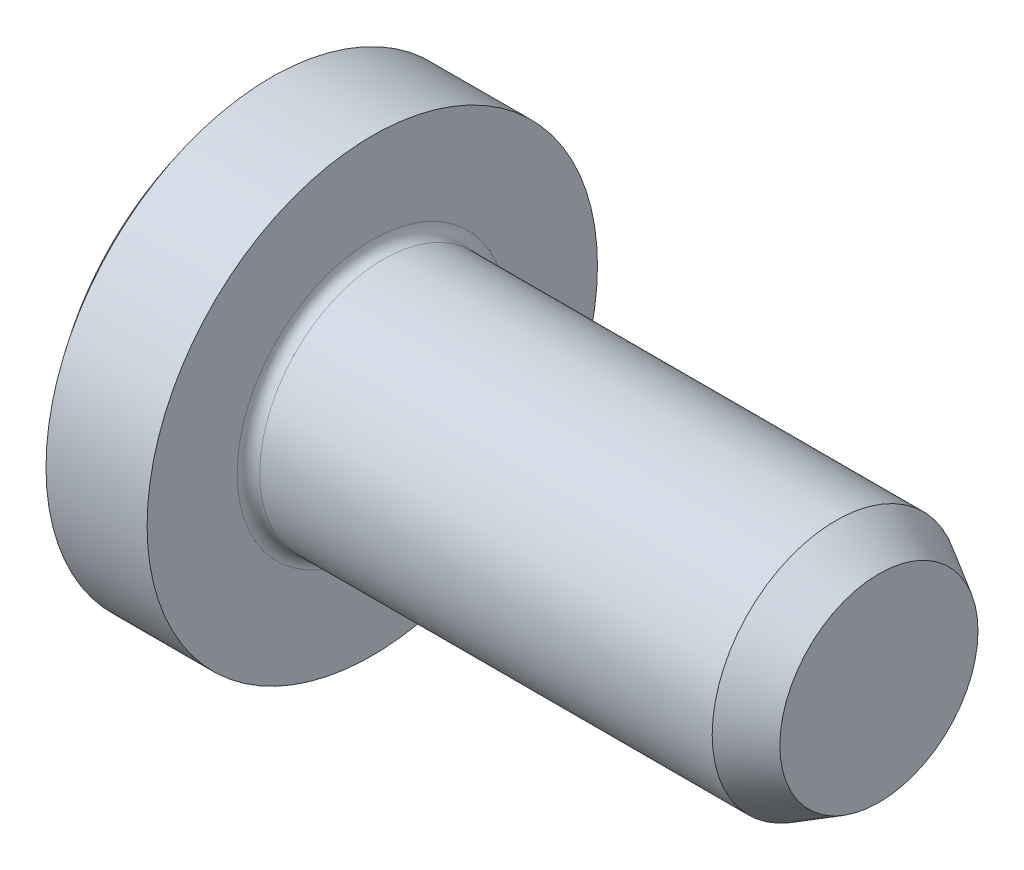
ISO-10303-21;
HEADER;
FILE_DESCRIPTION(('STEP AP214'),'2;1');
FILE_NAME('part.step','',(''),(''),'','','');
FILE_SCHEMA(('AUTOMOTIVE_DESIGN { 1 0 10303 214 1 1 1 1 }'));
ENDSEC;
DATA;
#1=APPLICATION_CONTEXT('core data for automotive mechanical design processes');
#2=APPLICATION_PROTOCOL_DEFINITION('international standard','automotive_design',2000,#1);
#3=PRODUCT_CONTEXT('',#1,'mechanical');
#4=PRODUCT('Part','Part','',(#3));
#5=PRODUCT_RELATED_PRODUCT_CATEGORY('part','',(#4));
#6=PRODUCT_DEFINITION_FORMATION('','',#4);
#7=PRODUCT_DEFINITION_CONTEXT('part definition',#1,'design');
#8=PRODUCT_DEFINITION('design','',#6,#7);
#9=PRODUCT_DEFINITION_SHAPE('','',#8);
#10=(LENGTH_UNIT() NAMED_UNIT(*) SI_UNIT(.MILLI.,.METRE.));
#11=(NAMED_UNIT(*) PLANE_ANGLE_UNIT() SI_UNIT($,.RADIAN.));
#12=(NAMED_UNIT(*) SI_UNIT($,.STERADIAN.) SOLID_ANGLE_UNIT());
#13=UNCERTAINTY_MEASURE_WITH_UNIT(LENGTH_MEASURE(1.E-05),#10,'distance_accuracy_value','');
#14=(GEOMETRIC_REPRESENTATION_CONTEXT(3) GLOBAL_UNCERTAINTY_ASSIGNED_CONTEXT((#13)) GLOBAL_UNIT_ASSIGNED_CONTEXT((#10,
#11,#12)) REPRESENTATION_CONTEXT('',''));
#15=CARTESIAN_POINT('',(0.,0.,0.));
#16=DIRECTION('',(0.,0.,1.));
#17=DIRECTION('',(1.,0.,0.));
#18=AXIS2_PLACEMENT_3D('',#15,#16,#17);
#19=CARTESIAN_POINT('',(1.6,0.,0.));
#20=DIRECTION('',(-1.,0.,0.));
#21=DIRECTION('',(0.,1.,0.));
#22=AXIS2_PLACEMENT_3D('',#19,#20,#21);
#23=SPHERICAL_SURFACE('',#22,3.2);
#24=CARTESIAN_POINT('',(-0.89799919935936,0.,0.));
#25=DIRECTION('',(-1.,0.,0.));
#26=DIRECTION('',(0.,0.,1.));
#27=AXIS2_PLACEMENT_3D('',#24,#25,#26);
#28=CIRCLE('',#27,2.);
#29=CARTESIAN_POINT('',(-0.89799919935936,0.,2.));
#30=VERTEX_POINT('',#29);
#31=EDGE_CURVE('E202',#30,#30,#28,.T.);
#32=ORIENTED_EDGE('',*,*,#31,.T.);
#33=EDGE_LOOP('',(#32));
#34=FACE_BOUND('',#33,.T.);
#35=CARTESIAN_POINT('',(1.56503616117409,0.0806815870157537,0.322726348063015));
#36=DIRECTION('',(0.104528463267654,-0.241206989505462,-0.964827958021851));
#37=DIRECTION('',(0.,0.970142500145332,-0.242535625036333));
#38=AXIS2_PLACEMENT_3D('',#35,#36,#37);
#39=CIRCLE('',#38,3.18247006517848);
#40=CARTESIAN_POINT('',(-1.45274996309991,0.934523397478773,-0.217677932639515));
#41=VERTEX_POINT('',#40);
#42=CARTESIAN_POINT('',(-1.54602165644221,0.569150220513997,-0.136439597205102));
#43=VERTEX_POINT('',#42);
#44=EDGE_CURVE('E405',#41,#43,#39,.F.);
#45=ORIENTED_EDGE('',*,*,#44,.F.);
#46=CARTESIAN_POINT('',(1.66379421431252,0.606961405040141,0.));
#47=DIRECTION('',(0.104528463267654,0.994521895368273,0.));
#48=DIRECTION('',(-0.994521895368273,0.104528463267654,0.));
#49=AXIS2_PLACEMENT_3D('',#46,#47,#48);
#50=CIRCLE('',#49,3.14126219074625);
#51=CARTESIAN_POINT('',(-1.45274996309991,0.934523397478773,0.217677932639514));
#52=VERTEX_POINT('',#51);
#53=EDGE_CURVE('E66',#52,#41,#50,.F.);
#54=ORIENTED_EDGE('',*,*,#53,.F.);
#55=CARTESIAN_POINT('',(1.56503616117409,0.0806815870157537,-0.322726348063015));
#56=DIRECTION('',(0.104528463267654,-0.241206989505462,0.964827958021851));
#57=DIRECTION('',(0.,-0.970142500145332,-0.242535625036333));
#58=AXIS2_PLACEMENT_3D('',#55,#56,#57);
#59=CIRCLE('',#58,3.18247006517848);
#60=CARTESIAN_POINT('',(-1.54602165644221,0.569150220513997,0.136439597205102));
#61=VERTEX_POINT('',#60);
#62=EDGE_CURVE('E400',#61,#52,#59,.F.);
#63=ORIENTED_EDGE('',*,*,#62,.F.);
#64=CARTESIAN_POINT('',(1.60749262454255,0.0356437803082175,0.061736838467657));
#65=DIRECTION('',(0.104528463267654,0.497260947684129,0.861281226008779));
#66=DIRECTION('',(0.,-0.866025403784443,0.499999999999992));
#67=AXIS2_PLACEMENT_3D('',#64,#65,#66);
#68=CIRCLE('',#67,3.19919707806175);
#69=CARTESIAN_POINT('',(-1.57234339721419,0.296847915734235,0.296847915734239));
#70=VERTEX_POINT('',#69);
#71=EDGE_CURVE('E392',#70,#61,#68,.F.);
#72=ORIENTED_EDGE('',*,*,#71,.F.);
#73=CARTESIAN_POINT('',(1.60749262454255,0.0617368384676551,0.0356437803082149));
#74=DIRECTION('',(0.104528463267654,0.861281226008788,0.497260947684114));
#75=DIRECTION('',(0.,-0.499999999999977,0.866025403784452));
#76=AXIS2_PLACEMENT_3D('',#73,#74,#75);
#77=CIRCLE('',#76,3.19919707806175);
#78=CARTESIAN_POINT('',(-1.54602165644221,0.136439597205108,0.569150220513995));
#79=VERTEX_POINT('',#78);
#80=EDGE_CURVE('E391',#79,#70,#77,.F.);
#81=ORIENTED_EDGE('',*,*,#80,.F.);
#82=CARTESIAN_POINT('',(1.56503616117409,-0.322726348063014,0.0806815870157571));
#83=DIRECTION('',(0.104528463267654,0.964827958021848,-0.241206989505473));
#84=DIRECTION('',(0.,0.242535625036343,0.970142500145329));
#85=AXIS2_PLACEMENT_3D('',#82,#83,#84);
#86=CIRCLE('',#85,3.18247006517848);
#87=CARTESIAN_POINT('',(-1.45274996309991,0.217677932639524,0.934523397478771));
#88=VERTEX_POINT('',#87);
#89=EDGE_CURVE('E387',#88,#79,#86,.F.);
#90=ORIENTED_EDGE('',*,*,#89,.F.);
#91=CARTESIAN_POINT('',(1.66379421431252,0.,0.606961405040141));
#92=DIRECTION('',(0.104528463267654,0.,0.994521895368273));
#93=DIRECTION('',(0.994521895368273,0.,-0.104528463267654));
#94=AXIS2_PLACEMENT_3D('',#91,#92,#93);
#95=CIRCLE('',#94,3.14126219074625);
#96=CARTESIAN_POINT('',(-1.45274996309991,-0.217677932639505,0.934523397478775));
#97=VERTEX_POINT('',#96);
#98=EDGE_CURVE('E388',#97,#88,#95,.F.);
#99=ORIENTED_EDGE('',*,*,#98,.F.);
#100=CARTESIAN_POINT('',(1.56503616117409,0.322726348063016,0.0806815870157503));
#101=DIRECTION('',(0.104528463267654,-0.964827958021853,-0.241206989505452));
#102=DIRECTION('',(0.,0.242535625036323,-0.970142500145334));
#103=AXIS2_PLACEMENT_3D('',#100,#101,#102);
#104=CIRCLE('',#103,3.18247006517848);
#105=CARTESIAN_POINT('',(-1.54602165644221,-0.136439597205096,0.569150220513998));
#106=VERTEX_POINT('',#105);
#107=EDGE_CURVE('E384',#106,#97,#104,.F.);
#108=ORIENTED_EDGE('',*,*,#107,.F.);
#109=CARTESIAN_POINT('',(1.60749262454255,-0.0617368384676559,0.0356437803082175));
#110=DIRECTION('',(0.104528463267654,-0.861281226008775,0.497260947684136));
#111=DIRECTION('',(0.,-0.499999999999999,-0.866025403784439));
#112=AXIS2_PLACEMENT_3D('',#109,#110,#111);
#113=CIRCLE('',#112,3.19919707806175);
#114=CARTESIAN_POINT('',(-1.57234339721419,-0.296847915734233,0.296847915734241));
#115=VERTEX_POINT('',#114);
#116=EDGE_CURVE('E379',#115,#106,#113,.F.);
#117=ORIENTED_EDGE('',*,*,#116,.F.);
#118=CARTESIAN_POINT('',(1.60749262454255,-0.035643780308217,0.0617368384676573));
#119=DIRECTION('',(0.104528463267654,-0.497260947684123,0.861281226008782));
#120=DIRECTION('',(0.,-0.866025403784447,-0.499999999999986));
#121=AXIS2_PLACEMENT_3D('',#118,#119,#120);
#122=CIRCLE('',#121,3.19919707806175);
#123=CARTESIAN_POINT('',(-1.54602165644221,-0.569150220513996,0.136439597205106));
#124=VERTEX_POINT('',#123);
#125=EDGE_CURVE('E380',#124,#115,#122,.F.);
#126=ORIENTED_EDGE('',*,*,#125,.F.);
#127=CARTESIAN_POINT('',(1.56503616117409,-0.0806815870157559,-0.322726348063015));
#128=DIRECTION('',(0.104528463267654,0.241206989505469,0.964827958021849));
#129=DIRECTION('',(0.,-0.97014250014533,0.242535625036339));
#130=AXIS2_PLACEMENT_3D('',#127,#128,#129);
#131=CIRCLE('',#130,3.18247006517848);
#132=CARTESIAN_POINT('',(-1.45274996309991,-0.934523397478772,0.217677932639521));
#133=VERTEX_POINT('',#132);
#134=EDGE_CURVE('E372',#133,#124,#131,.F.);
#135=ORIENTED_EDGE('',*,*,#134,.F.);
#136=CARTESIAN_POINT('',(1.66379421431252,-0.606961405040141,0.));
#137=DIRECTION('',(0.104528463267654,-0.994521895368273,0.));
#138=DIRECTION('',(0.994521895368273,0.104528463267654,0.));
#139=AXIS2_PLACEMENT_3D('',#136,#137,#138);
#140=CIRCLE('',#139,3.14126219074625);
#141=CARTESIAN_POINT('',(-1.45274996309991,-0.934523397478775,-0.217677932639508));
#142=VERTEX_POINT('',#141);
#143=EDGE_CURVE('E371',#142,#133,#140,.F.);
#144=ORIENTED_EDGE('',*,*,#143,.F.);
#145=CARTESIAN_POINT('',(1.56503616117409,-0.0806815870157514,0.322726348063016));
#146=DIRECTION('',(0.104528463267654,0.241206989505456,-0.964827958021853));
#147=DIRECTION('',(0.,0.970142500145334,0.242535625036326));
#148=AXIS2_PLACEMENT_3D('',#145,#146,#147);
#149=CIRCLE('',#148,3.18247006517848);
#150=CARTESIAN_POINT('',(-1.54602165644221,-0.569150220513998,-0.136439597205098));
#151=VERTEX_POINT('',#150);
#152=EDGE_CURVE('E368',#151,#142,#149,.F.);
#153=ORIENTED_EDGE('',*,*,#152,.F.);
#154=CARTESIAN_POINT('',(1.60749262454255,-0.0356437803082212,-0.0617368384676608));
#155=DIRECTION('',(0.104528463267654,-0.497260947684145,-0.861281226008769));
#156=DIRECTION('',(0.,0.866025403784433,-0.500000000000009));
#157=AXIS2_PLACEMENT_3D('',#154,#155,#156);
#158=CIRCLE('',#157,3.19919707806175);
#159=CARTESIAN_POINT('',(-1.57234339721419,-0.296847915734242,-0.296847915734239));
#160=VERTEX_POINT('',#159);
#161=EDGE_CURVE('E362',#160,#151,#158,.F.);
#162=ORIENTED_EDGE('',*,*,#161,.F.);
#163=CARTESIAN_POINT('',(1.60749262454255,-0.0617368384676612,-0.0356437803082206));
#164=DIRECTION('',(0.104528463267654,-0.861281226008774,-0.497260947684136));
#165=DIRECTION('',(0.,0.5,-0.866025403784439));
#166=AXIS2_PLACEMENT_3D('',#163,#164,#165);
#167=CIRCLE('',#166,3.19919707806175);
#168=CARTESIAN_POINT('',(-1.54602165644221,-0.136439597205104,-0.569150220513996));
#169=VERTEX_POINT('',#168);
#170=EDGE_CURVE('E365',#169,#160,#167,.F.);
#171=ORIENTED_EDGE('',*,*,#170,.F.);
#172=CARTESIAN_POINT('',(1.56503616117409,0.322726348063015,-0.0806815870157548));
#173=DIRECTION('',(0.104528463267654,-0.96482795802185,0.241206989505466));
#174=DIRECTION('',(0.,-0.242535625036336,-0.970142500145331));
#175=AXIS2_PLACEMENT_3D('',#172,#173,#174);
#176=CIRCLE('',#175,3.18247006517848);
#177=CARTESIAN_POINT('',(-1.45274996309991,-0.217677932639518,-0.934523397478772));
#178=VERTEX_POINT('',#177);
#179=EDGE_CURVE('E360',#178,#169,#176,.F.);
#180=ORIENTED_EDGE('',*,*,#179,.F.);
#181=CARTESIAN_POINT('',(1.66379421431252,0.,-0.606961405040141));
#182=DIRECTION('',(0.104528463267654,0.,-0.994521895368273));
#183=DIRECTION('',(-0.994521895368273,0.,-0.104528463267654));
#184=AXIS2_PLACEMENT_3D('',#181,#182,#183);
#185=CIRCLE('',#184,3.14126219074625);
#186=CARTESIAN_POINT('',(-1.45274996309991,0.217677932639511,-0.934523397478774));
#187=VERTEX_POINT('',#186);
#188=EDGE_CURVE('E358',#187,#178,#185,.F.);
#189=ORIENTED_EDGE('',*,*,#188,.F.);
#190=CARTESIAN_POINT('',(1.56503616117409,-0.322726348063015,-0.0806815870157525));
#191=DIRECTION('',(0.104528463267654,0.964827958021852,0.241206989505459));
#192=DIRECTION('',(0.,-0.242535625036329,0.970142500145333));
#193=AXIS2_PLACEMENT_3D('',#190,#191,#192);
#194=CIRCLE('',#193,3.18247006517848);
#195=CARTESIAN_POINT('',(-1.54602165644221,0.1364395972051,-0.569150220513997));
#196=VERTEX_POINT('',#195);
#197=EDGE_CURVE('E355',#196,#187,#194,.F.);
#198=ORIENTED_EDGE('',*,*,#197,.F.);
#199=CARTESIAN_POINT('',(1.60749262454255,0.0617368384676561,-0.035643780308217));
#200=DIRECTION('',(0.104528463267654,0.861281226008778,-0.497260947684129));
#201=DIRECTION('',(0.,0.499999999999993,0.866025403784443));
#202=AXIS2_PLACEMENT_3D('',#199,#200,#201);
#203=CIRCLE('',#202,3.19919707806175);
#204=CARTESIAN_POINT('',(-1.57234339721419,0.296847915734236,-0.296847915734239));
#205=VERTEX_POINT('',#204);
#206=EDGE_CURVE('E347',#205,#196,#203,.F.);
#207=ORIENTED_EDGE('',*,*,#206,.F.);
#208=CARTESIAN_POINT('',(1.60749262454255,0.0356437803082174,-0.061736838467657));
#209=DIRECTION('',(0.104528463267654,0.497260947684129,-0.861281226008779));
#210=DIRECTION('',(0.,0.866025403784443,0.499999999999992));
#211=AXIS2_PLACEMENT_3D('',#208,#209,#210);
#212=CIRCLE('',#211,3.19919707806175);
#213=EDGE_CURVE('E346',#43,#205,#212,.F.);
#214=ORIENTED_EDGE('',*,*,#213,.F.);
#215=EDGE_LOOP('',(#45,#54,#63,#72,#81,#90,#99,#108,#117,#126,#135,#144,#153,#162,#171,#180,
#189,#198,#207,#214));
#216=FACE_BOUND('',#215,.T.);
#217=ADVANCED_FACE('F43',(#34,#216),#23,.T.);
#218=CARTESIAN_POINT('',(0.,1.1,0.));
#219=DIRECTION('',(-1.,0.,0.));
#220=DIRECTION('',(0.,0.,1.));
#221=AXIS2_PLACEMENT_3D('',#218,#219,#220);
#222=PLANE('',#221);
#223=CARTESIAN_POINT('',(0.,0.,0.));
#224=DIRECTION('',(-1.,0.,0.));
#225=DIRECTION('',(0.,0.,1.));
#226=AXIS2_PLACEMENT_3D('',#223,#224,#225);
#227=CIRCLE('',#226,1.2);
#228=CARTESIAN_POINT('',(0.,0.,1.2));
#229=VERTEX_POINT('',#228);
#230=EDGE_CURVE('E55',#229,#229,#227,.T.);
#231=ORIENTED_EDGE('',*,*,#230,.T.);
#232=EDGE_LOOP('',(#231));
#233=FACE_BOUND('',#232,.T.);
#234=CARTESIAN_POINT('',(0.,0.,0.));
#235=DIRECTION('',(-1.,0.,0.));
#236=DIRECTION('',(0.,0.,1.));
#237=AXIS2_PLACEMENT_3D('',#234,#235,#236);
#238=CIRCLE('',#237,2.);
#239=CARTESIAN_POINT('',(0.,0.,2.));
#240=VERTEX_POINT('',#239);
#241=EDGE_CURVE('E206',#240,#240,#238,.T.);
#242=ORIENTED_EDGE('',*,*,#241,.F.);
#243=EDGE_LOOP('',(#242));
#244=FACE_BOUND('',#243,.T.);
#245=ADVANCED_FACE('F407',(#233,#244),#222,.F.);
#246=CARTESIAN_POINT('',(0.,0.,0.));
#247=DIRECTION('',(-1.,0.,0.));
#248=DIRECTION('',(0.,0.,1.));
#249=AXIS2_PLACEMENT_3D('',#246,#247,#248);
#250=CYLINDRICAL_SURFACE('',#249,2.);
#251=ORIENTED_EDGE('',*,*,#31,.F.);
#252=EDGE_LOOP('',(#251));
#253=FACE_BOUND('',#252,.T.);
#254=ORIENTED_EDGE('',*,*,#241,.T.);
#255=EDGE_LOOP('',(#254));
#256=FACE_BOUND('',#255,.T.);
#257=ADVANCED_FACE('F429',(#253,#256),#250,.T.);
#258=CARTESIAN_POINT('',(4.5,1.1,0.));
#259=DIRECTION('',(-1.,0.,0.));
#260=DIRECTION('',(0.,0.,1.));
#261=AXIS2_PLACEMENT_3D('',#258,#259,#260);
#262=PLANE('',#261);
#263=CARTESIAN_POINT('',(4.5,0.,0.));
#264=DIRECTION('',(-1.,0.,0.));
#265=DIRECTION('',(0.,0.,1.));
#266=AXIS2_PLACEMENT_3D('',#263,#264,#265);
#267=CIRCLE('',#266,0.88);
#268=CARTESIAN_POINT('',(4.5,0.,0.88));
#269=VERTEX_POINT('',#268);
#270=EDGE_CURVE('E341',#269,#269,#267,.F.);
#271=ORIENTED_EDGE('',*,*,#270,.T.);
#272=EDGE_LOOP('',(#271));
#273=FACE_BOUND('',#272,.T.);
#274=ADVANCED_FACE('F432',(#273),#262,.F.);
#275=CARTESIAN_POINT('',(0.,0.,0.));
#276=DIRECTION('',(-1.,0.,0.));
#277=DIRECTION('',(0.,0.,1.));
#278=AXIS2_PLACEMENT_3D('',#275,#276,#277);
#279=CYLINDRICAL_SURFACE('',#278,1.1);
#280=CARTESIAN_POINT('',(0.1,0.,0.));
#281=DIRECTION('',(-1.,0.,0.));
#282=DIRECTION('',(0.,0.,1.));
#283=AXIS2_PLACEMENT_3D('',#280,#281,#282);
#284=CIRCLE('',#283,1.1);
#285=CARTESIAN_POINT('',(0.1,0.,1.1));
#286=VERTEX_POINT('',#285);
#287=EDGE_CURVE('E11',#286,#286,#284,.F.);
#288=ORIENTED_EDGE('',*,*,#287,.T.);
#289=EDGE_LOOP('',(#288));
#290=FACE_BOUND('',#289,.T.);
#291=CARTESIAN_POINT('',(4.11894882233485,0.,0.));
#292=DIRECTION('',(-1.,0.,0.));
#293=DIRECTION('',(0.,0.,1.));
#294=AXIS2_PLACEMENT_3D('',#291,#292,#293);
#295=CIRCLE('',#294,1.1);
#296=CARTESIAN_POINT('',(4.11894882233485,0.,1.1));
#297=VERTEX_POINT('',#296);
#298=EDGE_CURVE('E339',#297,#297,#295,.T.);
#299=ORIENTED_EDGE('',*,*,#298,.T.);
#300=EDGE_LOOP('',(#299));
#301=FACE_BOUND('',#300,.T.);
#302=ADVANCED_FACE('F437',(#290,#301),#279,.T.);
#303=CARTESIAN_POINT('',(4.11894882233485,0.,0.));
#304=DIRECTION('',(-1.,0.,0.));
#305=DIRECTION('',(0.,0.,1.));
#306=AXIS2_PLACEMENT_3D('',#303,#304,#305);
#307=CONICAL_SURFACE('',#306,1.1,0.523598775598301);
#308=ORIENTED_EDGE('',*,*,#270,.F.);
#309=EDGE_LOOP('',(#308));
#310=FACE_BOUND('',#309,.T.);
#311=ORIENTED_EDGE('',*,*,#298,.F.);
#312=EDGE_LOOP('',(#311));
#313=FACE_BOUND('',#312,.T.);
#314=ADVANCED_FACE('F438',(#310,#313),#307,.T.);
#315=CARTESIAN_POINT('',(-1.6,0.95,-0.2375));
#316=DIRECTION('',(0.104528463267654,-0.241206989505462,-0.964827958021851));
#317=DIRECTION('',(0.,0.970142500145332,-0.242535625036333));
#318=AXIS2_PLACEMENT_3D('',#315,#316,#317);
#319=PLANE('',#318);
#320=ORIENTED_EDGE('',*,*,#44,.T.);
#321=DIRECTION('',(-0.993634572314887,0.0156427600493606,-0.111560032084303));
#322=VECTOR('',#321,1.);
#323=CARTESIAN_POINT('',(-1.6,0.57,-0.1425));
#324=LINE('',#323,#322);
#325=CARTESIAN_POINT('',(-0.8,0.557405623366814,-0.052680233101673));
#326=VERTEX_POINT('',#325);
#327=EDGE_CURVE('E56',#326,#43,#324,.T.);
#328=ORIENTED_EDGE('',*,*,#327,.F.);
#329=DIRECTION('',(0.,-0.970142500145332,0.242535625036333));
#330=VECTOR('',#329,1.);
#331=CARTESIAN_POINT('',(-0.8,0.0203932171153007,0.081572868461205));
#332=LINE('',#331,#330);
#333=CARTESIAN_POINT('',(-0.8,0.865916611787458,-0.129807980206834));
#334=VERTEX_POINT('',#333);
#335=EDGE_CURVE('E190',#326,#334,#332,.F.);
#336=ORIENTED_EDGE('',*,*,#335,.T.);
#337=DIRECTION('',(-0.985727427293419,0.103604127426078,-0.132693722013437));
#338=VECTOR('',#337,1.);
#339=CARTESIAN_POINT('',(-1.53787007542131,0.943469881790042,-0.229136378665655));
#340=LINE('',#339,#338);
#341=EDGE_CURVE('E194',#334,#41,#340,.T.);
#342=ORIENTED_EDGE('',*,*,#341,.T.);
#343=EDGE_LOOP('',(#320,#328,#336,#342));
#344=FACE_BOUND('',#343,.T.);
#345=ADVANCED_FACE('F192',(#344),#319,.F.);
#346=CARTESIAN_POINT('',(-1.6,0.95,0.2375));
#347=DIRECTION('',(0.104528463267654,0.994521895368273,0.));
#348=DIRECTION('',(-0.994521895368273,0.104528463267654,0.));
#349=AXIS2_PLACEMENT_3D('',#346,#347,#348);
#350=PLANE('',#349);
#351=ORIENTED_EDGE('',*,*,#53,.T.);
#352=ORIENTED_EDGE('',*,*,#341,.F.);
#353=DIRECTION('',(0.,0.,-1.));
#354=VECTOR('',#353,1.);
#355=CARTESIAN_POINT('',(-0.8,0.865916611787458,0.));
#356=LINE('',#355,#354);
#357=CARTESIAN_POINT('',(-0.8,0.865916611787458,0.129807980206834));
#358=VERTEX_POINT('',#357);
#359=EDGE_CURVE('E182',#334,#358,#356,.F.);
#360=ORIENTED_EDGE('',*,*,#359,.T.);
#361=DIRECTION('',(-0.985727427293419,0.103604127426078,0.132693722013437));
#362=VECTOR('',#361,1.);
#363=CARTESIAN_POINT('',(-1.6,0.95,0.2375));
#364=LINE('',#363,#362);
#365=EDGE_CURVE('E204',#358,#52,#364,.T.);
#366=ORIENTED_EDGE('',*,*,#365,.T.);
#367=EDGE_LOOP('',(#351,#352,#360,#366));
#368=FACE_BOUND('',#367,.T.);
#369=ADVANCED_FACE('F198',(#368),#350,.F.);
#370=CARTESIAN_POINT('',(-1.6,0.95,0.2375));
#371=DIRECTION('',(0.104528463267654,-0.241206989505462,0.964827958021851));
#372=DIRECTION('',(0.,-0.970142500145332,-0.242535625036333));
#373=AXIS2_PLACEMENT_3D('',#370,#371,#372);
#374=PLANE('',#373);
#375=ORIENTED_EDGE('',*,*,#62,.T.);
#376=ORIENTED_EDGE('',*,*,#365,.F.);
#377=DIRECTION('',(0.,0.970142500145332,0.242535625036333));
#378=VECTOR('',#377,1.);
#379=CARTESIAN_POINT('',(-0.8,0.0203932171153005,-0.0815728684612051));
#380=LINE('',#379,#378);
#381=CARTESIAN_POINT('',(-0.8,0.557405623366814,0.052680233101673));
#382=VERTEX_POINT('',#381);
#383=EDGE_CURVE('E186',#358,#382,#380,.F.);
#384=ORIENTED_EDGE('',*,*,#383,.T.);
#385=DIRECTION('',(-0.993634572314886,0.0156427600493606,0.111560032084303));
#386=VECTOR('',#385,1.);
#387=CARTESIAN_POINT('',(-1.61643715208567,0.57025876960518,0.14434547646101));
#388=LINE('',#387,#386);
#389=EDGE_CURVE('E213',#382,#61,#388,.T.);
#390=ORIENTED_EDGE('',*,*,#389,.T.);
#391=EDGE_LOOP('',(#375,#376,#384,#390));
#392=FACE_BOUND('',#391,.T.);
#393=ADVANCED_FACE('F497',(#392),#374,.F.);
#394=CARTESIAN_POINT('',(-1.6,0.57,0.1425));
#395=DIRECTION('',(0.104528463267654,0.497260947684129,0.861281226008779));
#396=DIRECTION('',(0.,-0.866025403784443,0.499999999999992));
#397=AXIS2_PLACEMENT_3D('',#394,#395,#396);
#398=PLANE('',#397);
#399=ORIENTED_EDGE('',*,*,#71,.T.);
#400=ORIENTED_EDGE('',*,*,#389,.F.);
#401=DIRECTION('',(0.,0.866025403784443,-0.499999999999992));
#402=VECTOR('',#401,1.);
#403=CARTESIAN_POINT('',(-0.8,0.162162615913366,0.280873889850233));
#404=LINE('',#403,#402);
#405=CARTESIAN_POINT('',(-0.8,0.237422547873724,0.237422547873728));
#406=VERTEX_POINT('',#405);
#407=EDGE_CURVE('E287',#382,#406,#404,.F.);
#408=ORIENTED_EDGE('',*,*,#407,.T.);
#409=DIRECTION('',(-0.994132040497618,0.0764901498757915,0.0764901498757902));
#410=VECTOR('',#409,1.);
#411=CARTESIAN_POINT('',(-1.60871040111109,0.299646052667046,0.299646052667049));
#412=LINE('',#411,#410);
#413=EDGE_CURVE('E280',#406,#70,#412,.T.);
#414=ORIENTED_EDGE('',*,*,#413,.T.);
#415=EDGE_LOOP('',(#399,#400,#408,#414));
#416=FACE_BOUND('',#415,.T.);
#417=ADVANCED_FACE('F507',(#416),#398,.F.);
#418=CARTESIAN_POINT('',(-1.6,0.142500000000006,0.569999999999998));
#419=DIRECTION('',(0.104528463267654,0.861281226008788,0.497260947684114));
#420=DIRECTION('',(0.,-0.499999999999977,0.866025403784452));
#421=AXIS2_PLACEMENT_3D('',#418,#419,#420);
#422=PLANE('',#421);
#423=ORIENTED_EDGE('',*,*,#80,.T.);
#424=ORIENTED_EDGE('',*,*,#413,.F.);
#425=DIRECTION('',(0.,0.499999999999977,-0.866025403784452));
#426=VECTOR('',#425,1.);
#427=CARTESIAN_POINT('',(-0.8,0.280873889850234,0.16216261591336));
#428=LINE('',#427,#426);
#429=CARTESIAN_POINT('',(-0.8,0.0526802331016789,0.557405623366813));
#430=VERTEX_POINT('',#429);
#431=EDGE_CURVE('E286',#406,#430,#428,.F.);
#432=ORIENTED_EDGE('',*,*,#431,.T.);
#433=DIRECTION('',(-0.993634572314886,0.111560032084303,0.0156427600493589));
#434=VECTOR('',#433,1.);
#435=CARTESIAN_POINT('',(-1.6,0.142500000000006,0.569999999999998));
#436=LINE('',#435,#434);
#437=EDGE_CURVE('E271',#430,#79,#436,.T.);
#438=ORIENTED_EDGE('',*,*,#437,.T.);
#439=EDGE_LOOP('',(#423,#424,#432,#438));
#440=FACE_BOUND('',#439,.T.);
#441=ADVANCED_FACE('F516',(#440),#422,.F.);
#442=CARTESIAN_POINT('',(-1.6,0.23750000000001,0.949999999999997));
#443=DIRECTION('',(0.104528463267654,0.964827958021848,-0.241206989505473));
#444=DIRECTION('',(0.,0.242535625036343,0.970142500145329));
#445=AXIS2_PLACEMENT_3D('',#442,#443,#444);
#446=PLANE('',#445);
#447=ORIENTED_EDGE('',*,*,#89,.T.);
#448=ORIENTED_EDGE('',*,*,#437,.F.);
#449=DIRECTION('',(0.,-0.242535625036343,-0.970142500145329));
#450=VECTOR('',#449,1.);
#451=CARTESIAN_POINT('',(-0.8,-0.0815728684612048,0.0203932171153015));
#452=LINE('',#451,#450);
#453=CARTESIAN_POINT('',(-0.8,0.129807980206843,0.865916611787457));
#454=VERTEX_POINT('',#453);
#455=EDGE_CURVE('E292',#430,#454,#452,.F.);
#456=ORIENTED_EDGE('',*,*,#455,.T.);
#457=DIRECTION('',(-0.985727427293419,0.132693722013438,0.103604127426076));
#458=VECTOR('',#457,1.);
#459=CARTESIAN_POINT('',(-1.53787007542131,0.229136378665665,0.94346988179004));
#460=LINE('',#459,#458);
#461=EDGE_CURVE('E266',#454,#88,#460,.T.);
#462=ORIENTED_EDGE('',*,*,#461,.T.);
#463=EDGE_LOOP('',(#447,#448,#456,#462));
#464=FACE_BOUND('',#463,.T.);
#465=ADVANCED_FACE('F530',(#464),#446,.F.);
#466=CARTESIAN_POINT('',(-1.6,-0.23749999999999,0.950000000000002));
#467=DIRECTION('',(0.104528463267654,0.,0.994521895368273));
#468=DIRECTION('',(0.994521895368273,0.,-0.104528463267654));
#469=AXIS2_PLACEMENT_3D('',#466,#467,#468);
#470=PLANE('',#469);
#471=ORIENTED_EDGE('',*,*,#98,.T.);
#472=ORIENTED_EDGE('',*,*,#461,.F.);
#473=DIRECTION('',(0.,1.,0.));
#474=VECTOR('',#473,1.);
#475=CARTESIAN_POINT('',(-0.8,0.,0.865916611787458));
#476=LINE('',#475,#474);
#477=CARTESIAN_POINT('',(-0.8,-0.129807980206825,0.86591661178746));
#478=VERTEX_POINT('',#477);
#479=EDGE_CURVE('E294',#454,#478,#476,.F.);
#480=ORIENTED_EDGE('',*,*,#479,.T.);
#481=DIRECTION('',(-0.985727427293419,-0.132693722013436,0.103604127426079));
#482=VECTOR('',#481,1.);
#483=CARTESIAN_POINT('',(-1.6,-0.23749999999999,0.950000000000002));
#484=LINE('',#483,#482);
#485=EDGE_CURVE('E262',#478,#97,#484,.T.);
#486=ORIENTED_EDGE('',*,*,#485,.T.);
#487=EDGE_LOOP('',(#471,#472,#480,#486));
#488=FACE_BOUND('',#487,.T.);
#489=ADVANCED_FACE('F536',(#488),#470,.F.);
#490=CARTESIAN_POINT('',(-1.6,-0.23749999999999,0.950000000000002));
#491=DIRECTION('',(0.104528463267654,-0.964827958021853,-0.241206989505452));
#492=DIRECTION('',(0.,0.242535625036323,-0.970142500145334));
#493=AXIS2_PLACEMENT_3D('',#490,#491,#492);
#494=PLANE('',#493);
#495=ORIENTED_EDGE('',*,*,#107,.T.);
#496=ORIENTED_EDGE('',*,*,#485,.F.);
#497=DIRECTION('',(0.,-0.242535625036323,0.970142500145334));
#498=VECTOR('',#497,1.);
#499=CARTESIAN_POINT('',(-0.8,0.0815728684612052,0.0203932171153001));
#500=LINE('',#499,#498);
#501=CARTESIAN_POINT('',(-0.8,-0.0526802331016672,0.557405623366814));
#502=VERTEX_POINT('',#501);
#503=EDGE_CURVE('E296',#478,#502,#500,.F.);
#504=ORIENTED_EDGE('',*,*,#503,.T.);
#505=DIRECTION('',(-0.993634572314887,-0.111560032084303,0.0156427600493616));
#506=VECTOR('',#505,1.);
#507=CARTESIAN_POINT('',(-1.61643715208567,-0.144345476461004,0.570258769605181));
#508=LINE('',#507,#506);
#509=EDGE_CURVE('E264',#502,#106,#508,.T.);
#510=ORIENTED_EDGE('',*,*,#509,.T.);
#511=EDGE_LOOP('',(#495,#496,#504,#510));
#512=FACE_BOUND('',#511,.T.);
#513=ADVANCED_FACE('F550',(#512),#494,.F.);
#514=CARTESIAN_POINT('',(-1.6,-0.142499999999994,0.570000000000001));
#515=DIRECTION('',(0.104528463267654,-0.861281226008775,0.497260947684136));
#516=DIRECTION('',(0.,-0.499999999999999,-0.866025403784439));
#517=AXIS2_PLACEMENT_3D('',#514,#515,#516);
#518=PLANE('',#517);
#519=ORIENTED_EDGE('',*,*,#116,.T.);
#520=ORIENTED_EDGE('',*,*,#509,.F.);
#521=DIRECTION('',(0.,0.499999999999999,0.866025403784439));
#522=VECTOR('',#521,1.);
#523=CARTESIAN_POINT('',(-0.8,-0.280873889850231,0.162162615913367));
#524=LINE('',#523,#522);
#525=CARTESIAN_POINT('',(-0.8,-0.237422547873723,0.23742254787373));
#526=VERTEX_POINT('',#525);
#527=EDGE_CURVE('E301',#502,#526,#524,.F.);
#528=ORIENTED_EDGE('',*,*,#527,.T.);
#529=DIRECTION('',(-0.994132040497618,-0.07649014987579,0.0764901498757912));
#530=VECTOR('',#529,1.);
#531=CARTESIAN_POINT('',(-1.60871040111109,-0.299646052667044,0.299646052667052));
#532=LINE('',#531,#530);
#533=EDGE_CURVE('E260',#526,#115,#532,.T.);
#534=ORIENTED_EDGE('',*,*,#533,.T.);
#535=EDGE_LOOP('',(#519,#520,#528,#534));
#536=FACE_BOUND('',#535,.T.);
#537=ADVANCED_FACE('F556',(#536),#518,.F.);
#538=CARTESIAN_POINT('',(-1.6,-0.569999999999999,0.142500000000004));
#539=DIRECTION('',(0.104528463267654,-0.497260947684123,0.861281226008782));
#540=DIRECTION('',(0.,-0.866025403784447,-0.499999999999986));
#541=AXIS2_PLACEMENT_3D('',#538,#539,#540);
#542=PLANE('',#541);
#543=ORIENTED_EDGE('',*,*,#125,.T.);
#544=ORIENTED_EDGE('',*,*,#533,.F.);
#545=DIRECTION('',(0.,0.866025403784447,0.499999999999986));
#546=VECTOR('',#545,1.);
#547=CARTESIAN_POINT('',(-0.8,-0.162162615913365,0.280873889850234));
#548=LINE('',#547,#546);
#549=CARTESIAN_POINT('',(-0.8,-0.557405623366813,0.0526802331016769));
#550=VERTEX_POINT('',#549);
#551=EDGE_CURVE('E302',#526,#550,#548,.F.);
#552=ORIENTED_EDGE('',*,*,#551,.T.);
#553=DIRECTION('',(-0.993634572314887,-0.0156427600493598,0.111560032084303));
#554=VECTOR('',#553,1.);
#555=CARTESIAN_POINT('',(-1.6,-0.569999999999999,0.142500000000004));
#556=LINE('',#555,#554);
#557=EDGE_CURVE('E254',#550,#124,#556,.T.);
#558=ORIENTED_EDGE('',*,*,#557,.T.);
#559=EDGE_LOOP('',(#543,#544,#552,#558));
#560=FACE_BOUND('',#559,.T.);
#561=ADVANCED_FACE('F568',(#560),#542,.F.);
#562=CARTESIAN_POINT('',(-1.6,-0.949999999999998,0.237500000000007));
#563=DIRECTION('',(0.104528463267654,0.241206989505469,0.964827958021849));
#564=DIRECTION('',(0.,-0.97014250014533,0.242535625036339));
#565=AXIS2_PLACEMENT_3D('',#562,#563,#564);
#566=PLANE('',#565);
#567=ORIENTED_EDGE('',*,*,#134,.T.);
#568=ORIENTED_EDGE('',*,*,#557,.F.);
#569=DIRECTION('',(0.,0.97014250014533,-0.242535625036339));
#570=VECTOR('',#569,1.);
#571=CARTESIAN_POINT('',(-0.8,-0.0203932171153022,-0.0815728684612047));
#572=LINE('',#571,#570);
#573=CARTESIAN_POINT('',(-0.8,-0.865916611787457,0.12980798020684));
#574=VERTEX_POINT('',#573);
#575=EDGE_CURVE('E310',#550,#574,#572,.F.);
#576=ORIENTED_EDGE('',*,*,#575,.T.);
#577=DIRECTION('',(-0.985727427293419,-0.103604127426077,0.132693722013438));
#578=VECTOR('',#577,1.);
#579=CARTESIAN_POINT('',(-1.53787007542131,-0.943469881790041,0.229136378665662));
#580=LINE('',#579,#578);
#581=EDGE_CURVE('E248',#574,#133,#580,.T.);
#582=ORIENTED_EDGE('',*,*,#581,.T.);
#583=EDGE_LOOP('',(#567,#568,#576,#582));
#584=FACE_BOUND('',#583,.T.);
#585=ADVANCED_FACE('F579',(#584),#566,.F.);
#586=CARTESIAN_POINT('',(-1.6,-0.950000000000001,-0.237499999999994));
#587=DIRECTION('',(0.104528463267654,-0.994521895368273,0.));
#588=DIRECTION('',(0.994521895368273,0.104528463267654,0.));
#589=AXIS2_PLACEMENT_3D('',#586,#587,#588);
#590=PLANE('',#589);
#591=ORIENTED_EDGE('',*,*,#143,.T.);
#592=ORIENTED_EDGE('',*,*,#581,.F.);
#593=DIRECTION('',(0.,0.,1.));
#594=VECTOR('',#593,1.);
#595=CARTESIAN_POINT('',(-0.8,-0.865916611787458,0.));
#596=LINE('',#595,#594);
#597=CARTESIAN_POINT('',(-0.8,-0.865916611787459,-0.129807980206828));
#598=VERTEX_POINT('',#597);
#599=EDGE_CURVE('E309',#574,#598,#596,.F.);
#600=ORIENTED_EDGE('',*,*,#599,.T.);
#601=DIRECTION('',(-0.985727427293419,-0.103604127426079,-0.132693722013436));
#602=VECTOR('',#601,1.);
#603=CARTESIAN_POINT('',(-1.6,-0.950000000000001,-0.237499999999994));
#604=LINE('',#603,#602);
#605=EDGE_CURVE('E244',#598,#142,#604,.T.);
#606=ORIENTED_EDGE('',*,*,#605,.T.);
#607=EDGE_LOOP('',(#591,#592,#600,#606));
#608=FACE_BOUND('',#607,.T.);
#609=ADVANCED_FACE('F590',(#608),#590,.F.);
#610=CARTESIAN_POINT('',(-1.6,-0.950000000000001,-0.237499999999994));
#611=DIRECTION('',(0.104528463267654,0.241206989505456,-0.964827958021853));
#612=DIRECTION('',(0.,0.970142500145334,0.242535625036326));
#613=AXIS2_PLACEMENT_3D('',#610,#611,#612);
#614=PLANE('',#613);
#615=ORIENTED_EDGE('',*,*,#152,.T.);
#616=ORIENTED_EDGE('',*,*,#605,.F.);
#617=DIRECTION('',(0.,-0.970142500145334,-0.242535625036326));
#618=VECTOR('',#617,1.);
#619=CARTESIAN_POINT('',(-0.8,-0.0203932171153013,0.0815728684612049));
#620=LINE('',#619,#618);
#621=CARTESIAN_POINT('',(-0.8,-0.557405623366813,-0.052680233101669));
#622=VERTEX_POINT('',#621);
#623=EDGE_CURVE('E312',#598,#622,#620,.F.);
#624=ORIENTED_EDGE('',*,*,#623,.T.);
#625=DIRECTION('',(-0.993634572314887,-0.0156427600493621,-0.111560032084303));
#626=VECTOR('',#625,1.);
#627=CARTESIAN_POINT('',(-1.61643715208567,-0.570258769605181,-0.144345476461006));
#628=LINE('',#627,#626);
#629=EDGE_CURVE('E241',#622,#151,#628,.T.);
#630=ORIENTED_EDGE('',*,*,#629,.T.);
#631=EDGE_LOOP('',(#615,#616,#624,#630));
#632=FACE_BOUND('',#631,.T.);
#633=ADVANCED_FACE('F596',(#632),#614,.F.);
#634=CARTESIAN_POINT('',(-1.6,-0.570000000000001,-0.142499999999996));
#635=DIRECTION('',(0.104528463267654,-0.497260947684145,-0.861281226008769));
#636=DIRECTION('',(0.,0.866025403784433,-0.500000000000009));
#637=AXIS2_PLACEMENT_3D('',#634,#635,#636);
#638=PLANE('',#637);
#639=ORIENTED_EDGE('',*,*,#161,.T.);
#640=ORIENTED_EDGE('',*,*,#629,.F.);
#641=DIRECTION('',(0.,-0.866025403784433,0.500000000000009));
#642=VECTOR('',#641,1.);
#643=CARTESIAN_POINT('',(-0.8,-0.162162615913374,-0.280873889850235));
#644=LINE('',#643,#642);
#645=CARTESIAN_POINT('',(-0.8,-0.237422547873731,-0.237422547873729));
#646=VERTEX_POINT('',#645);
#647=EDGE_CURVE('E317',#622,#646,#644,.F.);
#648=ORIENTED_EDGE('',*,*,#647,.T.);
#649=DIRECTION('',(-0.994132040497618,-0.0764901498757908,-0.07649014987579));
#650=VECTOR('',#649,1.);
#651=CARTESIAN_POINT('',(-1.60871040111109,-0.299646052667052,-0.299646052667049));
#652=LINE('',#651,#650);
#653=EDGE_CURVE('E240',#646,#160,#652,.T.);
#654=ORIENTED_EDGE('',*,*,#653,.T.);
#655=EDGE_LOOP('',(#639,#640,#648,#654));
#656=FACE_BOUND('',#655,.T.);
#657=ADVANCED_FACE('F610',(#656),#638,.F.);
#658=CARTESIAN_POINT('',(-1.6,-0.142500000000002,-0.569999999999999));
#659=DIRECTION('',(0.104528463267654,-0.861281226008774,-0.497260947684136));
#660=DIRECTION('',(0.,0.5,-0.866025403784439));
#661=AXIS2_PLACEMENT_3D('',#658,#659,#660);
#662=PLANE('',#661);
#663=ORIENTED_EDGE('',*,*,#170,.T.);
#664=ORIENTED_EDGE('',*,*,#653,.F.);
#665=DIRECTION('',(0.,-0.5,0.866025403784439));
#666=VECTOR('',#665,1.);
#667=CARTESIAN_POINT('',(-0.8,-0.280873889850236,-0.162162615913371));
#668=LINE('',#667,#666);
#669=CARTESIAN_POINT('',(-0.8,-0.0526802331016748,-0.557405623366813));
#670=VERTEX_POINT('',#669);
#671=EDGE_CURVE('E316',#646,#670,#668,.F.);
#672=ORIENTED_EDGE('',*,*,#671,.T.);
#673=DIRECTION('',(-0.993634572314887,-0.111560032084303,-0.0156427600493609));
#674=VECTOR('',#673,1.);
#675=CARTESIAN_POINT('',(-1.6,-0.142500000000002,-0.569999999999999));
#676=LINE('',#675,#674);
#677=EDGE_CURVE('E231',#670,#169,#676,.T.);
#678=ORIENTED_EDGE('',*,*,#677,.T.);
#679=EDGE_LOOP('',(#663,#664,#672,#678));
#680=FACE_BOUND('',#679,.T.);
#681=ADVANCED_FACE('F616',(#680),#662,.F.);
#682=CARTESIAN_POINT('',(-1.6,-0.237500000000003,-0.949999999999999));
#683=DIRECTION('',(0.104528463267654,-0.96482795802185,0.241206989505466));
#684=DIRECTION('',(0.,-0.242535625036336,-0.970142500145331));
#685=AXIS2_PLACEMENT_3D('',#682,#683,#684);
#686=PLANE('',#685);
#687=ORIENTED_EDGE('',*,*,#179,.T.);
#688=ORIENTED_EDGE('',*,*,#677,.F.);
#689=DIRECTION('',(0.,0.242535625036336,0.970142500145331));
#690=VECTOR('',#689,1.);
#691=CARTESIAN_POINT('',(-0.8,0.0815728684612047,-0.020393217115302));
#692=LINE('',#691,#690);
#693=CARTESIAN_POINT('',(-0.8,-0.129807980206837,-0.865916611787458));
#694=VERTEX_POINT('',#693);
#695=EDGE_CURVE('E325',#670,#694,#692,.F.);
#696=ORIENTED_EDGE('',*,*,#695,.T.);
#697=DIRECTION('',(-0.985727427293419,-0.132693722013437,-0.103604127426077));
#698=VECTOR('',#697,1.);
#699=CARTESIAN_POINT('',(-1.53787007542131,-0.229136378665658,-0.943469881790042));
#700=LINE('',#699,#698);
#701=EDGE_CURVE('E230',#694,#178,#700,.T.);
#702=ORIENTED_EDGE('',*,*,#701,.T.);
#703=EDGE_LOOP('',(#687,#688,#696,#702));
#704=FACE_BOUND('',#703,.T.);
#705=ADVANCED_FACE('F628',(#704),#686,.F.);
#706=CARTESIAN_POINT('',(-1.6,0.237499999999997,-0.950000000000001));
#707=DIRECTION('',(0.104528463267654,0.,-0.994521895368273));
#708=DIRECTION('',(-0.994521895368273,0.,-0.104528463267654));
#709=AXIS2_PLACEMENT_3D('',#706,#707,#708);
#710=PLANE('',#709);
#711=ORIENTED_EDGE('',*,*,#188,.T.);
#712=ORIENTED_EDGE('',*,*,#701,.F.);
#713=DIRECTION('',(0.,-1.,0.));
#714=VECTOR('',#713,1.);
#715=CARTESIAN_POINT('',(-0.8,0.,-0.865916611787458));
#716=LINE('',#715,#714);
#717=CARTESIAN_POINT('',(-0.8,0.129807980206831,-0.865916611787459));
#718=VERTEX_POINT('',#717);
#719=EDGE_CURVE('E324',#694,#718,#716,.F.);
#720=ORIENTED_EDGE('',*,*,#719,.T.);
#721=DIRECTION('',(-0.985727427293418,0.132693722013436,-0.103604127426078));
#722=VECTOR('',#721,1.);
#723=CARTESIAN_POINT('',(-1.6,0.237499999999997,-0.950000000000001));
#724=LINE('',#723,#722);
#725=EDGE_CURVE('E223',#718,#187,#724,.T.);
#726=ORIENTED_EDGE('',*,*,#725,.T.);
#727=EDGE_LOOP('',(#711,#712,#720,#726));
#728=FACE_BOUND('',#727,.T.);
#729=ADVANCED_FACE('F637',(#728),#710,.F.);
#730=CARTESIAN_POINT('',(-1.6,0.237499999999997,-0.950000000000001));
#731=DIRECTION('',(0.104528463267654,0.964827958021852,0.241206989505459));
#732=DIRECTION('',(0.,-0.242535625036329,0.970142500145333));
#733=AXIS2_PLACEMENT_3D('',#730,#731,#732);
#734=PLANE('',#733);
#735=ORIENTED_EDGE('',*,*,#197,.T.);
#736=ORIENTED_EDGE('',*,*,#725,.F.);
#737=DIRECTION('',(0.,0.242535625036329,-0.970142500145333));
#738=VECTOR('',#737,1.);
#739=CARTESIAN_POINT('',(-0.8,-0.0815728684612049,-0.0203932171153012));
#740=LINE('',#739,#738);
#741=CARTESIAN_POINT('',(-0.8,0.0526802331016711,-0.557405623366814));
#742=VERTEX_POINT('',#741);
#743=EDGE_CURVE('E330',#718,#742,#740,.F.);
#744=ORIENTED_EDGE('',*,*,#743,.T.);
#745=DIRECTION('',(-0.993634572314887,0.111560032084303,-0.0156427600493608));
#746=VECTOR('',#745,1.);
#747=CARTESIAN_POINT('',(-1.61643715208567,0.144345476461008,-0.57025876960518));
#748=LINE('',#747,#746);
#749=EDGE_CURVE('E222',#742,#196,#748,.T.);
#750=ORIENTED_EDGE('',*,*,#749,.T.);
#751=EDGE_LOOP('',(#735,#736,#744,#750));
#752=FACE_BOUND('',#751,.T.);
#753=ADVANCED_FACE('F646',(#752),#734,.F.);
#754=CARTESIAN_POINT('',(-1.6,0.142499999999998,-0.57));
#755=DIRECTION('',(0.104528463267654,0.861281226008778,-0.497260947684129));
#756=DIRECTION('',(0.,0.499999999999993,0.866025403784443));
#757=AXIS2_PLACEMENT_3D('',#754,#755,#756);
#758=PLANE('',#757);
#759=ORIENTED_EDGE('',*,*,#206,.T.);
#760=ORIENTED_EDGE('',*,*,#749,.F.);
#761=DIRECTION('',(0.,-0.499999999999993,-0.866025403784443));
#762=VECTOR('',#761,1.);
#763=CARTESIAN_POINT('',(-0.8,0.280873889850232,-0.162162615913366));
#764=LINE('',#763,#762);
#765=CARTESIAN_POINT('',(-0.8,0.237422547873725,-0.237422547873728));
#766=VERTEX_POINT('',#765);
#767=EDGE_CURVE('E332',#742,#766,#764,.F.);
#768=ORIENTED_EDGE('',*,*,#767,.T.);
#769=DIRECTION('',(-0.994132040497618,0.0764901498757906,-0.0764901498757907));
#770=VECTOR('',#769,1.);
#771=CARTESIAN_POINT('',(-1.60871040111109,0.299646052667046,-0.299646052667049));
#772=LINE('',#771,#770);
#773=EDGE_CURVE('E219',#766,#205,#772,.T.);
#774=ORIENTED_EDGE('',*,*,#773,.T.);
#775=EDGE_LOOP('',(#759,#760,#768,#774));
#776=FACE_BOUND('',#775,.T.);
#777=ADVANCED_FACE('F660',(#776),#758,.F.);
#778=CARTESIAN_POINT('',(-1.6,0.57,-0.1425));
#779=DIRECTION('',(0.104528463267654,0.497260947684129,-0.861281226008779));
#780=DIRECTION('',(0.,0.866025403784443,0.499999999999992));
#781=AXIS2_PLACEMENT_3D('',#778,#779,#780);
#782=PLANE('',#781);
#783=ORIENTED_EDGE('',*,*,#213,.T.);
#784=ORIENTED_EDGE('',*,*,#773,.F.);
#785=DIRECTION('',(0.,-0.866025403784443,-0.499999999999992));
#786=VECTOR('',#785,1.);
#787=CARTESIAN_POINT('',(-0.8,0.162162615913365,-0.280873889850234));
#788=LINE('',#787,#786);
#789=EDGE_CURVE('E216',#766,#326,#788,.F.);
#790=ORIENTED_EDGE('',*,*,#789,.T.);
#791=ORIENTED_EDGE('',*,*,#327,.T.);
#792=EDGE_LOOP('',(#783,#784,#790,#791));
#793=FACE_BOUND('',#792,.T.);
#794=ADVANCED_FACE('F420',(#793),#782,.F.);
#795=CARTESIAN_POINT('',(-0.8,0.,0.));
#796=DIRECTION('',(-1.,0.,0.));
#797=DIRECTION('',(0.,0.,1.));
#798=AXIS2_PLACEMENT_3D('',#795,#796,#797);
#799=PLANE('',#798);
#800=ORIENTED_EDGE('',*,*,#335,.F.);
#801=ORIENTED_EDGE('',*,*,#789,.F.);
#802=ORIENTED_EDGE('',*,*,#767,.F.);
#803=ORIENTED_EDGE('',*,*,#743,.F.);
#804=ORIENTED_EDGE('',*,*,#719,.F.);
#805=ORIENTED_EDGE('',*,*,#695,.F.);
#806=ORIENTED_EDGE('',*,*,#671,.F.);
#807=ORIENTED_EDGE('',*,*,#647,.F.);
#808=ORIENTED_EDGE('',*,*,#623,.F.);
#809=ORIENTED_EDGE('',*,*,#599,.F.);
#810=ORIENTED_EDGE('',*,*,#575,.F.);
#811=ORIENTED_EDGE('',*,*,#551,.F.);
#812=ORIENTED_EDGE('',*,*,#527,.F.);
#813=ORIENTED_EDGE('',*,*,#503,.F.);
#814=ORIENTED_EDGE('',*,*,#479,.F.);
#815=ORIENTED_EDGE('',*,*,#455,.F.);
#816=ORIENTED_EDGE('',*,*,#431,.F.);
#817=ORIENTED_EDGE('',*,*,#407,.F.);
#818=ORIENTED_EDGE('',*,*,#383,.F.);
#819=ORIENTED_EDGE('',*,*,#359,.F.);
#820=EDGE_LOOP('',(#800,#801,#802,#803,#804,#805,#806,#807,#808,#809,#810,#811,#812,#813,#814,
#815,#816,#817,#818,#819));
#821=FACE_BOUND('',#820,.T.);
#822=ADVANCED_FACE('F184',(#821),#799,.T.);
#823=CARTESIAN_POINT('',(0.1,0.,0.));
#824=DIRECTION('',(-1.,0.,0.));
#825=DIRECTION('',(0.,0.,1.));
#826=AXIS2_PLACEMENT_3D('',#823,#824,#825);
#827=TOROIDAL_SURFACE('',#826,1.2,0.1);
#828=ORIENTED_EDGE('',*,*,#287,.F.);
#829=EDGE_LOOP('',(#828));
#830=FACE_BOUND('',#829,.T.);
#831=ORIENTED_EDGE('',*,*,#230,.F.);
#832=EDGE_LOOP('',(#831));
#833=FACE_BOUND('',#832,.T.);
#834=ADVANCED_FACE('F44',(#830,#833),#827,.F.);
#835=CLOSED_SHELL('',(#217,#245,#257,#274,#302,#314,#345,#369,#393,#417,#441,#465,#489,#513,
#537,#561,#585,#609,#633,#657,#681,#705,#729,#753,#777,#794,#822,#834));
#836=MANIFOLD_SOLID_BREP('B2',#835);
#837=ADVANCED_BREP_SHAPE_REPRESENTATION('',(#18,#836),#14);
#838=SHAPE_DEFINITION_REPRESENTATION(#9,#837);
ENDSEC;
END-ISO-10303-21;
